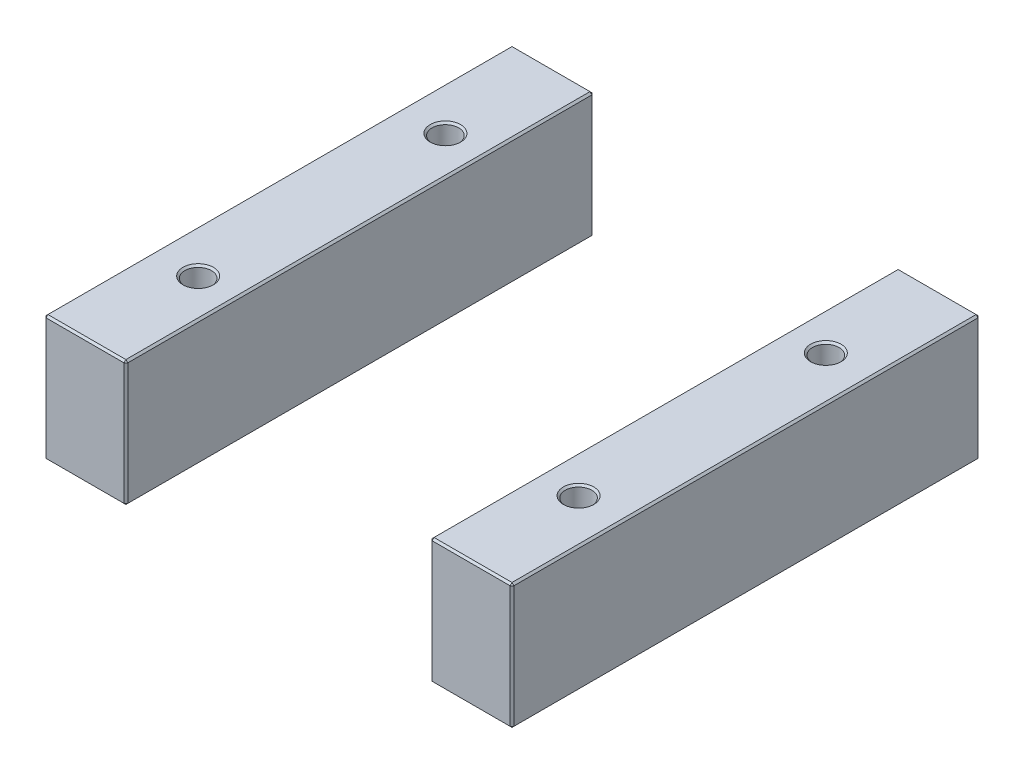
ISO-10303-21;
HEADER;
FILE_DESCRIPTION(('STEP AP214'),'2;1');
FILE_NAME('part.step','',(''),(''),'','','');
FILE_SCHEMA(('AUTOMOTIVE_DESIGN { 1 0 10303 214 1 1 1 1 }'));
ENDSEC;
DATA;
#1=APPLICATION_CONTEXT('core data for automotive mechanical design processes');
#2=APPLICATION_PROTOCOL_DEFINITION('international standard','automotive_design',2000,#1);
#3=PRODUCT_CONTEXT('',#1,'mechanical');
#4=PRODUCT('Part','Part','',(#3));
#5=PRODUCT_RELATED_PRODUCT_CATEGORY('part','',(#4));
#6=PRODUCT_DEFINITION_FORMATION('','',#4);
#7=PRODUCT_DEFINITION_CONTEXT('part definition',#1,'design');
#8=PRODUCT_DEFINITION('design','',#6,#7);
#9=PRODUCT_DEFINITION_SHAPE('','',#8);
#10=(LENGTH_UNIT() NAMED_UNIT(*) SI_UNIT(.MILLI.,.METRE.));
#11=(NAMED_UNIT(*) PLANE_ANGLE_UNIT() SI_UNIT($,.RADIAN.));
#12=(NAMED_UNIT(*) SI_UNIT($,.STERADIAN.) SOLID_ANGLE_UNIT());
#13=UNCERTAINTY_MEASURE_WITH_UNIT(LENGTH_MEASURE(1.E-05),#10,'distance_accuracy_value','');
#14=(GEOMETRIC_REPRESENTATION_CONTEXT(3) GLOBAL_UNCERTAINTY_ASSIGNED_CONTEXT((#13)) GLOBAL_UNIT_ASSIGNED_CONTEXT((#10,
#11,#12)) REPRESENTATION_CONTEXT('',''));
#15=CARTESIAN_POINT('',(0.,0.,0.));
#16=DIRECTION('',(0.,0.,1.));
#17=DIRECTION('',(1.,0.,0.));
#18=AXIS2_PLACEMENT_3D('',#15,#16,#17);
#19=CARTESIAN_POINT('',(-123.,66.,-123.));
#20=DIRECTION('',(0.,0.,1.));
#21=DIRECTION('',(1.,0.,0.));
#22=AXIS2_PLACEMENT_3D('',#19,#20,#21);
#23=PLANE('',#22);
#24=DIRECTION('',(-1.,0.,0.));
#25=VECTOR('',#24,1.);
#26=CARTESIAN_POINT('',(-123.,0.999999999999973,-123.));
#27=LINE('',#26,#25);
#28=CARTESIAN_POINT('',(-81.,0.999999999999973,-123.));
#29=VERTEX_POINT('',#28);
#30=CARTESIAN_POINT('',(-122.,0.999999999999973,-123.));
#31=VERTEX_POINT('',#30);
#32=EDGE_CURVE('P0_E137',#29,#31,#27,.T.);
#33=ORIENTED_EDGE('',*,*,#32,.T.);
#34=DIRECTION('',(0.,1.,0.));
#35=VECTOR('',#34,1.);
#36=CARTESIAN_POINT('',(-122.,66.,-123.));
#37=LINE('',#36,#35);
#38=CARTESIAN_POINT('',(-122.,65.,-123.));
#39=VERTEX_POINT('',#38);
#40=EDGE_CURVE('P0_E235',#31,#39,#37,.T.);
#41=ORIENTED_EDGE('',*,*,#40,.T.);
#42=DIRECTION('',(1.,0.,0.));
#43=VECTOR('',#42,1.);
#44=CARTESIAN_POINT('',(-123.,65.,-123.));
#45=LINE('',#44,#43);
#46=CARTESIAN_POINT('',(-81.,65.,-123.));
#47=VERTEX_POINT('',#46);
#48=EDGE_CURVE('P0_E233',#39,#47,#45,.T.);
#49=ORIENTED_EDGE('',*,*,#48,.T.);
#50=DIRECTION('',(0.,-1.,0.));
#51=VECTOR('',#50,1.);
#52=CARTESIAN_POINT('',(-81.,66.,-123.));
#53=LINE('',#52,#51);
#54=EDGE_CURVE('P0_E230',#47,#29,#53,.T.);
#55=ORIENTED_EDGE('',*,*,#54,.T.);
#56=EDGE_LOOP('',(#33,#41,#49,#55));
#57=FACE_BOUND('',#56,.T.);
#58=ADVANCED_FACE('P0_F16',(#57),#23,.F.);
#59=CARTESIAN_POINT('',(-123.,66.,123.));
#60=DIRECTION('',(1.,0.,0.));
#61=DIRECTION('',(0.,0.,-1.));
#62=AXIS2_PLACEMENT_3D('',#59,#60,#61);
#63=PLANE('',#62);
#64=DIRECTION('',(0.,1.,0.));
#65=VECTOR('',#64,1.);
#66=CARTESIAN_POINT('',(-123.,66.,122.));
#67=LINE('',#66,#65);
#68=CARTESIAN_POINT('',(-123.,0.999999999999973,122.));
#69=VERTEX_POINT('',#68);
#70=CARTESIAN_POINT('',(-123.,65.,122.));
#71=VERTEX_POINT('',#70);
#72=EDGE_CURVE('P0_E217',#69,#71,#67,.T.);
#73=ORIENTED_EDGE('',*,*,#72,.T.);
#74=DIRECTION('',(0.,0.,-1.));
#75=VECTOR('',#74,1.);
#76=CARTESIAN_POINT('',(-123.,65.,123.));
#77=LINE('',#76,#75);
#78=CARTESIAN_POINT('',(-123.,65.,-122.));
#79=VERTEX_POINT('',#78);
#80=EDGE_CURVE('P0_E228',#71,#79,#77,.T.);
#81=ORIENTED_EDGE('',*,*,#80,.T.);
#82=DIRECTION('',(0.,-1.,0.));
#83=VECTOR('',#82,1.);
#84=CARTESIAN_POINT('',(-123.,66.,-122.));
#85=LINE('',#84,#83);
#86=CARTESIAN_POINT('',(-123.,0.999999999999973,-122.));
#87=VERTEX_POINT('',#86);
#88=EDGE_CURVE('P0_E225',#79,#87,#85,.T.);
#89=ORIENTED_EDGE('',*,*,#88,.T.);
#90=DIRECTION('',(0.,0.,1.));
#91=VECTOR('',#90,1.);
#92=CARTESIAN_POINT('',(-123.,0.999999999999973,123.));
#93=LINE('',#92,#91);
#94=EDGE_CURVE('P0_E214',#87,#69,#93,.T.);
#95=ORIENTED_EDGE('',*,*,#94,.T.);
#96=EDGE_LOOP('',(#73,#81,#89,#95));
#97=FACE_BOUND('',#96,.T.);
#98=ADVANCED_FACE('P0_F302',(#97),#63,.F.);
#99=CARTESIAN_POINT('',(-123.,66.,123.));
#100=DIRECTION('',(0.,0.,-1.));
#101=DIRECTION('',(-1.,0.,0.));
#102=AXIS2_PLACEMENT_3D('',#99,#100,#101);
#103=PLANE('',#102);
#104=DIRECTION('',(-1.,0.,0.));
#105=VECTOR('',#104,1.);
#106=CARTESIAN_POINT('',(-123.,65.,123.));
#107=LINE('',#106,#105);
#108=CARTESIAN_POINT('',(-81.,65.,123.));
#109=VERTEX_POINT('',#108);
#110=CARTESIAN_POINT('',(-122.,65.,123.));
#111=VERTEX_POINT('',#110);
#112=EDGE_CURVE('P0_E242',#109,#111,#107,.T.);
#113=ORIENTED_EDGE('',*,*,#112,.T.);
#114=DIRECTION('',(0.,-1.,0.));
#115=VECTOR('',#114,1.);
#116=CARTESIAN_POINT('',(-122.,66.,123.));
#117=LINE('',#116,#115);
#118=CARTESIAN_POINT('',(-122.,0.999999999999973,123.));
#119=VERTEX_POINT('',#118);
#120=EDGE_CURVE('P0_E244',#111,#119,#117,.T.);
#121=ORIENTED_EDGE('',*,*,#120,.T.);
#122=DIRECTION('',(1.,0.,0.));
#123=VECTOR('',#122,1.);
#124=CARTESIAN_POINT('',(-80.,0.999999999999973,123.));
#125=LINE('',#124,#123);
#126=CARTESIAN_POINT('',(-81.,0.999999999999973,123.));
#127=VERTEX_POINT('',#126);
#128=EDGE_CURVE('P0_E240',#119,#127,#125,.T.);
#129=ORIENTED_EDGE('',*,*,#128,.T.);
#130=DIRECTION('',(0.,1.,0.));
#131=VECTOR('',#130,1.);
#132=CARTESIAN_POINT('',(-81.,66.,123.));
#133=LINE('',#132,#131);
#134=EDGE_CURVE('P0_E238',#127,#109,#133,.T.);
#135=ORIENTED_EDGE('',*,*,#134,.T.);
#136=EDGE_LOOP('',(#113,#121,#129,#135));
#137=FACE_BOUND('',#136,.T.);
#138=ADVANCED_FACE('P0_F341',(#137),#103,.F.);
#139=CARTESIAN_POINT('',(-80.,66.,-123.));
#140=DIRECTION('',(-1.,0.,0.));
#141=DIRECTION('',(0.,0.,1.));
#142=AXIS2_PLACEMENT_3D('',#139,#140,#141);
#143=PLANE('',#142);
#144=DIRECTION('',(0.,0.,1.));
#145=VECTOR('',#144,1.);
#146=CARTESIAN_POINT('',(-80.,65.,-123.));
#147=LINE('',#146,#145);
#148=CARTESIAN_POINT('',(-80.,65.,-122.));
#149=VERTEX_POINT('',#148);
#150=CARTESIAN_POINT('',(-80.,65.,122.));
#151=VERTEX_POINT('',#150);
#152=EDGE_CURVE('P0_E31',#149,#151,#147,.T.);
#153=ORIENTED_EDGE('',*,*,#152,.T.);
#154=DIRECTION('',(0.,-1.,0.));
#155=VECTOR('',#154,1.);
#156=CARTESIAN_POINT('',(-80.,66.,122.));
#157=LINE('',#156,#155);
#158=CARTESIAN_POINT('',(-80.,0.999999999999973,122.));
#159=VERTEX_POINT('',#158);
#160=EDGE_CURVE('P0_E190',#151,#159,#157,.T.);
#161=ORIENTED_EDGE('',*,*,#160,.T.);
#162=DIRECTION('',(0.,0.,-1.));
#163=VECTOR('',#162,1.);
#164=CARTESIAN_POINT('',(-80.,0.999999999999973,-123.));
#165=LINE('',#164,#163);
#166=CARTESIAN_POINT('',(-80.,0.999999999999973,-122.));
#167=VERTEX_POINT('',#166);
#168=EDGE_CURVE('P0_E256',#159,#167,#165,.T.);
#169=ORIENTED_EDGE('',*,*,#168,.T.);
#170=DIRECTION('',(0.,1.,0.));
#171=VECTOR('',#170,1.);
#172=CARTESIAN_POINT('',(-80.,66.,-122.));
#173=LINE('',#172,#171);
#174=EDGE_CURVE('P0_E36',#167,#149,#173,.T.);
#175=ORIENTED_EDGE('',*,*,#174,.T.);
#176=EDGE_LOOP('',(#153,#161,#169,#175));
#177=FACE_BOUND('',#176,.T.);
#178=ADVANCED_FACE('P0_F535',(#177),#143,.F.);
#179=CARTESIAN_POINT('',(0.,66.,0.));
#180=DIRECTION('',(0.,-1.,0.));
#181=DIRECTION('',(0.,0.,-1.));
#182=AXIS2_PLACEMENT_3D('',#179,#180,#181);
#183=PLANE('',#182);
#184=CARTESIAN_POINT('',(-100.,66.,65.));
#185=DIRECTION('',(0.,-1.,0.));
#186=DIRECTION('',(0.,0.,-1.));
#187=AXIS2_PLACEMENT_3D('',#184,#185,#186);
#188=CIRCLE('',#187,8.);
#189=CARTESIAN_POINT('',(-100.,66.,57.));
#190=VERTEX_POINT('',#189);
#191=EDGE_CURVE('P0_E24',#190,#190,#188,.T.);
#192=ORIENTED_EDGE('',*,*,#191,.T.);
#193=EDGE_LOOP('',(#192));
#194=FACE_BOUND('',#193,.T.);
#195=CARTESIAN_POINT('',(-100.,66.,-65.));
#196=DIRECTION('',(0.,-1.,0.));
#197=DIRECTION('',(0.,0.,-1.));
#198=AXIS2_PLACEMENT_3D('',#195,#196,#197);
#199=CIRCLE('',#198,8.);
#200=CARTESIAN_POINT('',(-100.,66.,-73.));
#201=VERTEX_POINT('',#200);
#202=EDGE_CURVE('P0_E189',#201,#201,#199,.T.);
#203=ORIENTED_EDGE('',*,*,#202,.T.);
#204=EDGE_LOOP('',(#203));
#205=FACE_BOUND('',#204,.T.);
#206=DIRECTION('',(0.,0.,1.));
#207=VECTOR('',#206,1.);
#208=CARTESIAN_POINT('',(-122.,66.,0.));
#209=LINE('',#208,#207);
#210=CARTESIAN_POINT('',(-122.,66.,-122.));
#211=VERTEX_POINT('',#210);
#212=CARTESIAN_POINT('',(-122.,66.,122.));
#213=VERTEX_POINT('',#212);
#214=EDGE_CURVE('P0_E251',#211,#213,#209,.T.);
#215=ORIENTED_EDGE('',*,*,#214,.T.);
#216=DIRECTION('',(1.,0.,0.));
#217=VECTOR('',#216,1.);
#218=CARTESIAN_POINT('',(0.,66.,122.));
#219=LINE('',#218,#217);
#220=CARTESIAN_POINT('',(-81.,66.,122.));
#221=VERTEX_POINT('',#220);
#222=EDGE_CURVE('P0_E253',#213,#221,#219,.T.);
#223=ORIENTED_EDGE('',*,*,#222,.T.);
#224=DIRECTION('',(0.,0.,-1.));
#225=VECTOR('',#224,1.);
#226=CARTESIAN_POINT('',(-81.,66.,0.));
#227=LINE('',#226,#225);
#228=CARTESIAN_POINT('',(-81.,66.,-122.));
#229=VERTEX_POINT('',#228);
#230=EDGE_CURVE('P0_E247',#221,#229,#227,.T.);
#231=ORIENTED_EDGE('',*,*,#230,.T.);
#232=DIRECTION('',(-1.,0.,0.));
#233=VECTOR('',#232,1.);
#234=CARTESIAN_POINT('',(0.,66.,-122.));
#235=LINE('',#234,#233);
#236=EDGE_CURVE('P0_E249',#229,#211,#235,.T.);
#237=ORIENTED_EDGE('',*,*,#236,.T.);
#238=EDGE_LOOP('',(#215,#223,#231,#237));
#239=FACE_BOUND('',#238,.T.);
#240=ADVANCED_FACE('P0_F195',(#194,#205,#239),#183,.F.);
#241=CARTESIAN_POINT('',(0.,0.,0.));
#242=DIRECTION('',(0.,-1.,0.));
#243=DIRECTION('',(0.,0.,-1.));
#244=AXIS2_PLACEMENT_3D('',#241,#242,#243);
#245=PLANE('',#244);
#246=CARTESIAN_POINT('',(-100.,0.,-65.));
#247=DIRECTION('',(0.,-1.,0.));
#248=DIRECTION('',(0.,0.,-1.));
#249=AXIS2_PLACEMENT_3D('',#246,#247,#248);
#250=CIRCLE('',#249,8.);
#251=CARTESIAN_POINT('',(-100.,0.,-73.));
#252=VERTEX_POINT('',#251);
#253=EDGE_CURVE('P0_E220',#252,#252,#250,.F.);
#254=ORIENTED_EDGE('',*,*,#253,.T.);
#255=EDGE_LOOP('',(#254));
#256=FACE_BOUND('',#255,.T.);
#257=CARTESIAN_POINT('',(-100.,0.,65.));
#258=DIRECTION('',(0.,-1.,0.));
#259=DIRECTION('',(0.,0.,-1.));
#260=AXIS2_PLACEMENT_3D('',#257,#258,#259);
#261=CIRCLE('',#260,8.);
#262=CARTESIAN_POINT('',(-100.,0.,57.));
#263=VERTEX_POINT('',#262);
#264=EDGE_CURVE('P0_E608',#263,#263,#261,.F.);
#265=ORIENTED_EDGE('',*,*,#264,.T.);
#266=EDGE_LOOP('',(#265));
#267=FACE_BOUND('',#266,.T.);
#268=DIRECTION('',(-1.,0.,0.));
#269=VECTOR('',#268,1.);
#270=CARTESIAN_POINT('',(-123.,0.,122.));
#271=LINE('',#270,#269);
#272=CARTESIAN_POINT('',(-81.,0.,122.));
#273=VERTEX_POINT('',#272);
#274=CARTESIAN_POINT('',(-122.,0.,122.));
#275=VERTEX_POINT('',#274);
#276=EDGE_CURVE('P0_E114',#273,#275,#271,.T.);
#277=ORIENTED_EDGE('',*,*,#276,.T.);
#278=DIRECTION('',(0.,0.,-1.));
#279=VECTOR('',#278,1.);
#280=CARTESIAN_POINT('',(-122.,0.,-123.));
#281=LINE('',#280,#279);
#282=CARTESIAN_POINT('',(-122.,0.,-122.));
#283=VERTEX_POINT('',#282);
#284=EDGE_CURVE('P0_E110',#275,#283,#281,.T.);
#285=ORIENTED_EDGE('',*,*,#284,.T.);
#286=DIRECTION('',(1.,0.,0.));
#287=VECTOR('',#286,1.);
#288=CARTESIAN_POINT('',(-80.,0.,-122.));
#289=LINE('',#288,#287);
#290=CARTESIAN_POINT('',(-81.,0.,-122.));
#291=VERTEX_POINT('',#290);
#292=EDGE_CURVE('P0_E104',#283,#291,#289,.T.);
#293=ORIENTED_EDGE('',*,*,#292,.T.);
#294=DIRECTION('',(0.,0.,1.));
#295=VECTOR('',#294,1.);
#296=CARTESIAN_POINT('',(-81.,0.,123.));
#297=LINE('',#296,#295);
#298=EDGE_CURVE('P0_E107',#291,#273,#297,.T.);
#299=ORIENTED_EDGE('',*,*,#298,.T.);
#300=EDGE_LOOP('',(#277,#285,#293,#299));
#301=FACE_BOUND('',#300,.T.);
#302=ADVANCED_FACE('P0_F106',(#256,#267,#301),#245,.T.);
#303=CARTESIAN_POINT('',(-100.,0.,-65.));
#304=DIRECTION('',(0.,1.,0.));
#305=DIRECTION('',(0.,0.,1.));
#306=AXIS2_PLACEMENT_3D('',#303,#304,#305);
#307=CYLINDRICAL_SURFACE('',#306,7.);
#308=CARTESIAN_POINT('',(-100.,65.,-65.));
#309=DIRECTION('',(0.,-1.,0.));
#310=DIRECTION('',(0.,0.,-1.));
#311=AXIS2_PLACEMENT_3D('',#308,#309,#310);
#312=CIRCLE('',#311,7.);
#313=CARTESIAN_POINT('',(-100.,65.,-72.));
#314=VERTEX_POINT('',#313);
#315=EDGE_CURVE('P0_E10',#314,#314,#312,.F.);
#316=ORIENTED_EDGE('',*,*,#315,.T.);
#317=EDGE_LOOP('',(#316));
#318=FACE_BOUND('',#317,.T.);
#319=CARTESIAN_POINT('',(-100.,0.999999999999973,-65.));
#320=DIRECTION('',(0.,-1.,0.));
#321=DIRECTION('',(0.,0.,-1.));
#322=AXIS2_PLACEMENT_3D('',#319,#320,#321);
#323=CIRCLE('',#322,7.);
#324=CARTESIAN_POINT('',(-100.,0.999999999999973,-72.));
#325=VERTEX_POINT('',#324);
#326=EDGE_CURVE('P0_E215',#325,#325,#323,.T.);
#327=ORIENTED_EDGE('',*,*,#326,.T.);
#328=EDGE_LOOP('',(#327));
#329=FACE_BOUND('',#328,.T.);
#330=ADVANCED_FACE('P0_F208',(#318,#329),#307,.F.);
#331=CARTESIAN_POINT('',(-100.,0.,65.));
#332=DIRECTION('',(0.,1.,0.));
#333=DIRECTION('',(0.,0.,1.));
#334=AXIS2_PLACEMENT_3D('',#331,#332,#333);
#335=CYLINDRICAL_SURFACE('',#334,7.);
#336=CARTESIAN_POINT('',(-100.,65.,65.));
#337=DIRECTION('',(0.,-1.,0.));
#338=DIRECTION('',(0.,0.,-1.));
#339=AXIS2_PLACEMENT_3D('',#336,#337,#338);
#340=CIRCLE('',#339,7.);
#341=CARTESIAN_POINT('',(-100.,65.,58.));
#342=VERTEX_POINT('',#341);
#343=EDGE_CURVE('P0_E186',#342,#342,#340,.F.);
#344=ORIENTED_EDGE('',*,*,#343,.T.);
#345=EDGE_LOOP('',(#344));
#346=FACE_BOUND('',#345,.T.);
#347=CARTESIAN_POINT('',(-100.,1.00000000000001,65.));
#348=DIRECTION('',(0.,-1.,0.));
#349=DIRECTION('',(0.,0.,-1.));
#350=AXIS2_PLACEMENT_3D('',#347,#348,#349);
#351=CIRCLE('',#350,7.);
#352=CARTESIAN_POINT('',(-100.,1.00000000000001,58.));
#353=VERTEX_POINT('',#352);
#354=EDGE_CURVE('P0_E212',#353,#353,#351,.T.);
#355=ORIENTED_EDGE('',*,*,#354,.T.);
#356=EDGE_LOOP('',(#355));
#357=FACE_BOUND('',#356,.T.);
#358=ADVANCED_FACE('P0_F204',(#346,#357),#335,.F.);
#359=CARTESIAN_POINT('',(-100.,0.,-65.));
#360=DIRECTION('',(0.,-1.,0.));
#361=DIRECTION('',(0.,0.,-1.));
#362=AXIS2_PLACEMENT_3D('',#359,#360,#361);
#363=CONICAL_SURFACE('',#362,8.,0.78539816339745);
#364=ORIENTED_EDGE('',*,*,#326,.F.);
#365=EDGE_LOOP('',(#364));
#366=FACE_BOUND('',#365,.T.);
#367=ORIENTED_EDGE('',*,*,#253,.F.);
#368=EDGE_LOOP('',(#367));
#369=FACE_BOUND('',#368,.T.);
#370=ADVANCED_FACE('P0_F207',(#366,#369),#363,.F.);
#371=CARTESIAN_POINT('',(-100.,0.,65.));
#372=DIRECTION('',(0.,-1.,0.));
#373=DIRECTION('',(0.,0.,-1.));
#374=AXIS2_PLACEMENT_3D('',#371,#372,#373);
#375=CONICAL_SURFACE('',#374,8.,0.785398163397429);
#376=ORIENTED_EDGE('',*,*,#354,.F.);
#377=EDGE_LOOP('',(#376));
#378=FACE_BOUND('',#377,.T.);
#379=ORIENTED_EDGE('',*,*,#264,.F.);
#380=EDGE_LOOP('',(#379));
#381=FACE_BOUND('',#380,.T.);
#382=ADVANCED_FACE('P0_F347',(#378,#381),#375,.F.);
#383=CARTESIAN_POINT('',(-80.,66.,122.));
#384=DIRECTION('',(-0.707106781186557,0.,-0.707106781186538));
#385=DIRECTION('',(0.,-1.,0.));
#386=AXIS2_PLACEMENT_3D('',#383,#384,#385);
#387=PLANE('',#386);
#388=DIRECTION('',(-0.707106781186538,0.,0.707106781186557));
#389=VECTOR('',#388,1.);
#390=CARTESIAN_POINT('',(-80.5,65.,122.5));
#391=LINE('',#390,#389);
#392=EDGE_CURVE('P0_E125',#109,#151,#391,.F.);
#393=ORIENTED_EDGE('',*,*,#392,.F.);
#394=ORIENTED_EDGE('',*,*,#134,.F.);
#395=DIRECTION('',(0.707106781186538,0.,-0.707106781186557));
#396=VECTOR('',#395,1.);
#397=CARTESIAN_POINT('',(-81.,0.999999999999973,123.));
#398=LINE('',#397,#396);
#399=EDGE_CURVE('P0_E181',#159,#127,#398,.F.);
#400=ORIENTED_EDGE('',*,*,#399,.F.);
#401=ORIENTED_EDGE('',*,*,#160,.F.);
#402=EDGE_LOOP('',(#393,#394,#400,#401));
#403=FACE_BOUND('',#402,.T.);
#404=ADVANCED_FACE('P0_F351',(#403),#387,.F.);
#405=CARTESIAN_POINT('',(-81.,66.,122.));
#406=DIRECTION('',(0.577350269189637,0.57735026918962,0.57735026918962));
#407=DIRECTION('',(0.707106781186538,0.,-0.707106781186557));
#408=AXIS2_PLACEMENT_3D('',#405,#406,#407);
#409=PLANE('',#408);
#410=DIRECTION('',(0.,0.707106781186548,-0.707106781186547));
#411=VECTOR('',#410,1.);
#412=CARTESIAN_POINT('',(-81.,66.,122.));
#413=LINE('',#412,#411);
#414=EDGE_CURVE('P0_E175',#109,#221,#413,.T.);
#415=ORIENTED_EDGE('',*,*,#414,.F.);
#416=ORIENTED_EDGE('',*,*,#392,.T.);
#417=DIRECTION('',(0.70710678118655,-0.707106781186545,0.));
#418=VECTOR('',#417,1.);
#419=CARTESIAN_POINT('',(-81.,66.,122.));
#420=LINE('',#419,#418);
#421=EDGE_CURVE('P0_E178',#221,#151,#420,.T.);
#422=ORIENTED_EDGE('',*,*,#421,.F.);
#423=EDGE_LOOP('',(#415,#416,#422));
#424=FACE_BOUND('',#423,.T.);
#425=ADVANCED_FACE('P0_F487',(#424),#409,.T.);
#426=CARTESIAN_POINT('',(-81.,0.999999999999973,123.));
#427=DIRECTION('',(0.577350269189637,-0.57735026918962,0.57735026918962));
#428=DIRECTION('',(0.707106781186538,0.,-0.707106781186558));
#429=AXIS2_PLACEMENT_3D('',#426,#427,#428);
#430=PLANE('',#429);
#431=DIRECTION('',(0.70710678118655,0.707106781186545,0.));
#432=VECTOR('',#431,1.);
#433=CARTESIAN_POINT('',(-80.5,0.499999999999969,122.));
#434=LINE('',#433,#432);
#435=EDGE_CURVE('P0_E123',#159,#273,#434,.F.);
#436=ORIENTED_EDGE('',*,*,#435,.F.);
#437=ORIENTED_EDGE('',*,*,#399,.T.);
#438=DIRECTION('',(0.,-0.707106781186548,-0.707106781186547));
#439=VECTOR('',#438,1.);
#440=CARTESIAN_POINT('',(-81.,0.999999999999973,123.));
#441=LINE('',#440,#439);
#442=EDGE_CURVE('P0_E172',#273,#127,#441,.F.);
#443=ORIENTED_EDGE('',*,*,#442,.F.);
#444=EDGE_LOOP('',(#436,#437,#443));
#445=FACE_BOUND('',#444,.T.);
#446=ADVANCED_FACE('P0_F478',(#445),#430,.T.);
#447=CARTESIAN_POINT('',(-81.,66.,0.));
#448=DIRECTION('',(-0.707106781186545,-0.70710678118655,0.));
#449=DIRECTION('',(0.,0.,-1.));
#450=AXIS2_PLACEMENT_3D('',#447,#448,#449);
#451=PLANE('',#450);
#452=ORIENTED_EDGE('',*,*,#421,.T.);
#453=ORIENTED_EDGE('',*,*,#152,.F.);
#454=DIRECTION('',(-0.70710678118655,0.707106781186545,0.));
#455=VECTOR('',#454,1.);
#456=CARTESIAN_POINT('',(-80.5,65.5,-122.));
#457=LINE('',#456,#455);
#458=EDGE_CURVE('P0_E165',#229,#149,#457,.F.);
#459=ORIENTED_EDGE('',*,*,#458,.F.);
#460=ORIENTED_EDGE('',*,*,#230,.F.);
#461=EDGE_LOOP('',(#452,#453,#459,#460));
#462=FACE_BOUND('',#461,.T.);
#463=ADVANCED_FACE('P0_F318',(#462),#451,.F.);
#464=CARTESIAN_POINT('',(0.,66.,122.));
#465=DIRECTION('',(0.,-0.707106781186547,-0.707106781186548));
#466=DIRECTION('',(1.,0.,0.));
#467=AXIS2_PLACEMENT_3D('',#464,#465,#466);
#468=PLANE('',#467);
#469=ORIENTED_EDGE('',*,*,#414,.T.);
#470=ORIENTED_EDGE('',*,*,#222,.F.);
#471=DIRECTION('',(0.,-0.707106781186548,0.707106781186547));
#472=VECTOR('',#471,1.);
#473=CARTESIAN_POINT('',(-122.,65.5,122.5));
#474=LINE('',#473,#472);
#475=EDGE_CURVE('P0_E162',#111,#213,#474,.F.);
#476=ORIENTED_EDGE('',*,*,#475,.F.);
#477=ORIENTED_EDGE('',*,*,#112,.F.);
#478=EDGE_LOOP('',(#469,#470,#476,#477));
#479=FACE_BOUND('',#478,.T.);
#480=ADVANCED_FACE('P0_F313',(#479),#468,.F.);
#481=CARTESIAN_POINT('',(-122.,66.,123.));
#482=DIRECTION('',(0.707106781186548,0.,-0.707106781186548));
#483=DIRECTION('',(0.,-1.,0.));
#484=AXIS2_PLACEMENT_3D('',#481,#482,#483);
#485=PLANE('',#484);
#486=DIRECTION('',(0.707106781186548,0.,0.707106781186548));
#487=VECTOR('',#486,1.);
#488=CARTESIAN_POINT('',(-122.,0.999999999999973,123.));
#489=LINE('',#488,#487);
#490=EDGE_CURVE('P0_E156',#119,#69,#489,.F.);
#491=ORIENTED_EDGE('',*,*,#490,.F.);
#492=ORIENTED_EDGE('',*,*,#120,.F.);
#493=DIRECTION('',(-0.707106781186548,0.,-0.707106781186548));
#494=VECTOR('',#493,1.);
#495=CARTESIAN_POINT('',(-123.,65.,122.));
#496=LINE('',#495,#494);
#497=EDGE_CURVE('P0_E159',#71,#111,#496,.F.);
#498=ORIENTED_EDGE('',*,*,#497,.F.);
#499=ORIENTED_EDGE('',*,*,#72,.F.);
#500=EDGE_LOOP('',(#491,#492,#498,#499));
#501=FACE_BOUND('',#500,.T.);
#502=ADVANCED_FACE('P0_F307',(#501),#485,.F.);
#503=CARTESIAN_POINT('',(-123.,0.999999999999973,123.));
#504=DIRECTION('',(0.,-0.707106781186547,0.707106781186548));
#505=DIRECTION('',(-1.,0.,0.));
#506=AXIS2_PLACEMENT_3D('',#503,#504,#505);
#507=PLANE('',#506);
#508=ORIENTED_EDGE('',*,*,#442,.T.);
#509=ORIENTED_EDGE('',*,*,#128,.F.);
#510=DIRECTION('',(0.,0.707106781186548,0.707106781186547));
#511=VECTOR('',#510,1.);
#512=CARTESIAN_POINT('',(-122.,0.999999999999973,123.));
#513=LINE('',#512,#511);
#514=EDGE_CURVE('P0_E134',#275,#119,#513,.T.);
#515=ORIENTED_EDGE('',*,*,#514,.F.);
#516=ORIENTED_EDGE('',*,*,#276,.F.);
#517=EDGE_LOOP('',(#508,#509,#515,#516));
#518=FACE_BOUND('',#517,.T.);
#519=ADVANCED_FACE('P0_F333',(#518),#507,.T.);
#520=CARTESIAN_POINT('',(-80.,0.999999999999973,-123.));
#521=DIRECTION('',(0.707106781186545,-0.70710678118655,0.));
#522=DIRECTION('',(0.,0.,1.));
#523=AXIS2_PLACEMENT_3D('',#520,#521,#522);
#524=PLANE('',#523);
#525=ORIENTED_EDGE('',*,*,#435,.T.);
#526=ORIENTED_EDGE('',*,*,#298,.F.);
#527=DIRECTION('',(-0.70710678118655,-0.707106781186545,0.));
#528=VECTOR('',#527,1.);
#529=CARTESIAN_POINT('',(-81.,0.,-122.));
#530=LINE('',#529,#528);
#531=EDGE_CURVE('P0_E120',#167,#291,#530,.T.);
#532=ORIENTED_EDGE('',*,*,#531,.F.);
#533=ORIENTED_EDGE('',*,*,#168,.F.);
#534=EDGE_LOOP('',(#525,#526,#532,#533));
#535=FACE_BOUND('',#534,.T.);
#536=ADVANCED_FACE('P0_F119',(#535),#524,.T.);
#537=CARTESIAN_POINT('',(-81.,66.,-123.));
#538=DIRECTION('',(-0.707106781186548,0.,0.707106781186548));
#539=DIRECTION('',(0.,-1.,0.));
#540=AXIS2_PLACEMENT_3D('',#537,#538,#539);
#541=PLANE('',#540);
#542=DIRECTION('',(0.707106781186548,0.,0.707106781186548));
#543=VECTOR('',#542,1.);
#544=CARTESIAN_POINT('',(-81.,65.,-123.));
#545=LINE('',#544,#543);
#546=EDGE_CURVE('P0_E168',#149,#47,#545,.F.);
#547=ORIENTED_EDGE('',*,*,#546,.F.);
#548=ORIENTED_EDGE('',*,*,#174,.F.);
#549=DIRECTION('',(-0.707106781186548,0.,-0.707106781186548));
#550=VECTOR('',#549,1.);
#551=CARTESIAN_POINT('',(-80.5,0.999999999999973,-122.5));
#552=LINE('',#551,#550);
#553=EDGE_CURVE('P0_E133',#29,#167,#552,.F.);
#554=ORIENTED_EDGE('',*,*,#553,.F.);
#555=ORIENTED_EDGE('',*,*,#54,.F.);
#556=EDGE_LOOP('',(#547,#548,#554,#555));
#557=FACE_BOUND('',#556,.T.);
#558=ADVANCED_FACE('P0_F323',(#557),#541,.F.);
#559=CARTESIAN_POINT('',(-81.,65.,-123.));
#560=DIRECTION('',(0.577350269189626,0.577350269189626,-0.577350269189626));
#561=DIRECTION('',(-0.707106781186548,0.,-0.707106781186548));
#562=AXIS2_PLACEMENT_3D('',#559,#560,#561);
#563=PLANE('',#562);
#564=ORIENTED_EDGE('',*,*,#458,.T.);
#565=ORIENTED_EDGE('',*,*,#546,.T.);
#566=DIRECTION('',(0.,-0.707106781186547,-0.707106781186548));
#567=VECTOR('',#566,1.);
#568=CARTESIAN_POINT('',(-81.,65.,-123.));
#569=LINE('',#568,#567);
#570=EDGE_CURVE('P0_E151',#229,#47,#569,.T.);
#571=ORIENTED_EDGE('',*,*,#570,.F.);
#572=EDGE_LOOP('',(#564,#565,#571));
#573=FACE_BOUND('',#572,.T.);
#574=ADVANCED_FACE('P0_F321',(#573),#563,.T.);
#575=CARTESIAN_POINT('',(-123.,65.,122.));
#576=DIRECTION('',(-0.577350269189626,0.577350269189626,0.577350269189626));
#577=DIRECTION('',(0.707106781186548,0.,0.707106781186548));
#578=AXIS2_PLACEMENT_3D('',#575,#576,#577);
#579=PLANE('',#578);
#580=ORIENTED_EDGE('',*,*,#497,.T.);
#581=ORIENTED_EDGE('',*,*,#475,.T.);
#582=DIRECTION('',(0.707106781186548,0.707106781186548,0.));
#583=VECTOR('',#582,1.);
#584=CARTESIAN_POINT('',(-123.,65.,122.));
#585=LINE('',#584,#583);
#586=EDGE_CURVE('P0_E142',#71,#213,#585,.T.);
#587=ORIENTED_EDGE('',*,*,#586,.F.);
#588=EDGE_LOOP('',(#580,#581,#587));
#589=FACE_BOUND('',#588,.T.);
#590=ADVANCED_FACE('P0_F310',(#589),#579,.T.);
#591=CARTESIAN_POINT('',(-122.,0.999999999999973,123.));
#592=DIRECTION('',(-0.577350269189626,-0.577350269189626,0.577350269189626));
#593=DIRECTION('',(0.707106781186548,0.,0.707106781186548));
#594=AXIS2_PLACEMENT_3D('',#591,#592,#593);
#595=PLANE('',#594);
#596=ORIENTED_EDGE('',*,*,#514,.T.);
#597=ORIENTED_EDGE('',*,*,#490,.T.);
#598=DIRECTION('',(0.707106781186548,-0.707106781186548,0.));
#599=VECTOR('',#598,1.);
#600=CARTESIAN_POINT('',(-122.5,0.499999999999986,122.));
#601=LINE('',#600,#599);
#602=EDGE_CURVE('P0_E138',#275,#69,#601,.F.);
#603=ORIENTED_EDGE('',*,*,#602,.F.);
#604=EDGE_LOOP('',(#596,#597,#603));
#605=FACE_BOUND('',#604,.T.);
#606=ADVANCED_FACE('P0_F368',(#605),#595,.T.);
#607=CARTESIAN_POINT('',(-81.,0.,-122.));
#608=DIRECTION('',(0.577350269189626,-0.577350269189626,-0.577350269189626));
#609=DIRECTION('',(-0.707106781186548,0.,-0.707106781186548));
#610=AXIS2_PLACEMENT_3D('',#607,#608,#609);
#611=PLANE('',#610);
#612=ORIENTED_EDGE('',*,*,#553,.T.);
#613=ORIENTED_EDGE('',*,*,#531,.T.);
#614=DIRECTION('',(0.,0.707106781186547,-0.707106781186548));
#615=VECTOR('',#614,1.);
#616=CARTESIAN_POINT('',(-81.,0.,-122.));
#617=LINE('',#616,#615);
#618=EDGE_CURVE('P0_E130',#29,#291,#617,.F.);
#619=ORIENTED_EDGE('',*,*,#618,.F.);
#620=EDGE_LOOP('',(#612,#613,#619));
#621=FACE_BOUND('',#620,.T.);
#622=ADVANCED_FACE('P0_F129',(#621),#611,.T.);
#623=CARTESIAN_POINT('',(0.,66.,-122.));
#624=DIRECTION('',(0.,-0.707106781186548,0.707106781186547));
#625=DIRECTION('',(-1.,0.,0.));
#626=AXIS2_PLACEMENT_3D('',#623,#624,#625);
#627=PLANE('',#626);
#628=ORIENTED_EDGE('',*,*,#570,.T.);
#629=ORIENTED_EDGE('',*,*,#48,.F.);
#630=DIRECTION('',(0.,0.707106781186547,0.707106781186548));
#631=VECTOR('',#630,1.);
#632=CARTESIAN_POINT('',(-122.,65.,-123.));
#633=LINE('',#632,#631);
#634=EDGE_CURVE('P0_E139',#211,#39,#633,.F.);
#635=ORIENTED_EDGE('',*,*,#634,.F.);
#636=ORIENTED_EDGE('',*,*,#236,.F.);
#637=EDGE_LOOP('',(#628,#629,#635,#636));
#638=FACE_BOUND('',#637,.T.);
#639=ADVANCED_FACE('P0_F286',(#638),#627,.F.);
#640=CARTESIAN_POINT('',(-122.,66.,0.));
#641=DIRECTION('',(0.707106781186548,-0.707106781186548,0.));
#642=DIRECTION('',(0.,0.,1.));
#643=AXIS2_PLACEMENT_3D('',#640,#641,#642);
#644=PLANE('',#643);
#645=ORIENTED_EDGE('',*,*,#586,.T.);
#646=ORIENTED_EDGE('',*,*,#214,.F.);
#647=DIRECTION('',(-0.707106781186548,-0.707106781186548,0.));
#648=VECTOR('',#647,1.);
#649=CARTESIAN_POINT('',(-122.5,65.5,-122.));
#650=LINE('',#649,#648);
#651=EDGE_CURVE('P0_E145',#79,#211,#650,.F.);
#652=ORIENTED_EDGE('',*,*,#651,.F.);
#653=ORIENTED_EDGE('',*,*,#80,.F.);
#654=EDGE_LOOP('',(#645,#646,#652,#653));
#655=FACE_BOUND('',#654,.T.);
#656=ADVANCED_FACE('P0_F280',(#655),#644,.F.);
#657=CARTESIAN_POINT('',(-123.,0.999999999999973,123.));
#658=DIRECTION('',(-0.707106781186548,-0.707106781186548,0.));
#659=DIRECTION('',(0.,0.,-1.));
#660=AXIS2_PLACEMENT_3D('',#657,#658,#659);
#661=PLANE('',#660);
#662=ORIENTED_EDGE('',*,*,#602,.T.);
#663=ORIENTED_EDGE('',*,*,#94,.F.);
#664=DIRECTION('',(-0.707106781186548,0.707106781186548,0.));
#665=VECTOR('',#664,1.);
#666=CARTESIAN_POINT('',(-123.,0.999999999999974,-122.));
#667=LINE('',#666,#665);
#668=EDGE_CURVE('P0_E267',#283,#87,#667,.T.);
#669=ORIENTED_EDGE('',*,*,#668,.F.);
#670=ORIENTED_EDGE('',*,*,#284,.F.);
#671=EDGE_LOOP('',(#662,#663,#669,#670));
#672=FACE_BOUND('',#671,.T.);
#673=ADVANCED_FACE('P0_F298',(#672),#661,.T.);
#674=CARTESIAN_POINT('',(-123.,0.999999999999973,-123.));
#675=DIRECTION('',(0.,-0.707106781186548,-0.707106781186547));
#676=DIRECTION('',(1.,0.,0.));
#677=AXIS2_PLACEMENT_3D('',#674,#675,#676);
#678=PLANE('',#677);
#679=ORIENTED_EDGE('',*,*,#618,.T.);
#680=ORIENTED_EDGE('',*,*,#292,.F.);
#681=DIRECTION('',(0.,-0.707106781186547,0.707106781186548));
#682=VECTOR('',#681,1.);
#683=CARTESIAN_POINT('',(-122.,0.499999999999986,-122.5));
#684=LINE('',#683,#682);
#685=EDGE_CURVE('P0_E265',#31,#283,#684,.T.);
#686=ORIENTED_EDGE('',*,*,#685,.F.);
#687=ORIENTED_EDGE('',*,*,#32,.F.);
#688=EDGE_LOOP('',(#679,#680,#686,#687));
#689=FACE_BOUND('',#688,.T.);
#690=ADVANCED_FACE('P0_F136',(#689),#678,.T.);
#691=CARTESIAN_POINT('',(-122.,65.,-123.));
#692=DIRECTION('',(-0.577350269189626,0.577350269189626,-0.577350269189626));
#693=DIRECTION('',(-0.707106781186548,0.,0.707106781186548));
#694=AXIS2_PLACEMENT_3D('',#691,#692,#693);
#695=PLANE('',#694);
#696=ORIENTED_EDGE('',*,*,#651,.T.);
#697=ORIENTED_EDGE('',*,*,#634,.T.);
#698=DIRECTION('',(0.707106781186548,0.,-0.707106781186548));
#699=VECTOR('',#698,1.);
#700=CARTESIAN_POINT('',(-122.,65.,-123.));
#701=LINE('',#700,#699);
#702=EDGE_CURVE('P0_E263',#79,#39,#701,.T.);
#703=ORIENTED_EDGE('',*,*,#702,.F.);
#704=EDGE_LOOP('',(#696,#697,#703));
#705=FACE_BOUND('',#704,.T.);
#706=ADVANCED_FACE('P0_F273',(#705),#695,.T.);
#707=CARTESIAN_POINT('',(-123.,0.999999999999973,-122.));
#708=DIRECTION('',(-0.577350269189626,-0.577350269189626,-0.577350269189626));
#709=DIRECTION('',(-0.707106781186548,0.,0.707106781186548));
#710=AXIS2_PLACEMENT_3D('',#707,#708,#709);
#711=PLANE('',#710);
#712=ORIENTED_EDGE('',*,*,#685,.T.);
#713=ORIENTED_EDGE('',*,*,#668,.T.);
#714=DIRECTION('',(-0.707106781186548,0.,0.707106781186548));
#715=VECTOR('',#714,1.);
#716=CARTESIAN_POINT('',(-123.,0.999999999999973,-122.));
#717=LINE('',#716,#715);
#718=EDGE_CURVE('P0_E261',#31,#87,#717,.T.);
#719=ORIENTED_EDGE('',*,*,#718,.F.);
#720=EDGE_LOOP('',(#712,#713,#719));
#721=FACE_BOUND('',#720,.T.);
#722=ADVANCED_FACE('P0_F294',(#721),#711,.T.);
#723=CARTESIAN_POINT('',(-123.,66.,-122.));
#724=DIRECTION('',(0.707106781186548,0.,0.707106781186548));
#725=DIRECTION('',(0.,-1.,0.));
#726=AXIS2_PLACEMENT_3D('',#723,#724,#725);
#727=PLANE('',#726);
#728=ORIENTED_EDGE('',*,*,#702,.T.);
#729=ORIENTED_EDGE('',*,*,#40,.F.);
#730=ORIENTED_EDGE('',*,*,#718,.T.);
#731=ORIENTED_EDGE('',*,*,#88,.F.);
#732=EDGE_LOOP('',(#728,#729,#730,#731));
#733=FACE_BOUND('',#732,.T.);
#734=ADVANCED_FACE('P0_F201',(#733),#727,.F.);
#735=CARTESIAN_POINT('',(-100.,65.,65.));
#736=DIRECTION('',(0.,1.,0.));
#737=DIRECTION('',(0.,0.,1.));
#738=AXIS2_PLACEMENT_3D('',#735,#736,#737);
#739=CONICAL_SURFACE('',#738,7.,0.785398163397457);
#740=ORIENTED_EDGE('',*,*,#191,.F.);
#741=EDGE_LOOP('',(#740));
#742=FACE_BOUND('',#741,.T.);
#743=ORIENTED_EDGE('',*,*,#343,.F.);
#744=EDGE_LOOP('',(#743));
#745=FACE_BOUND('',#744,.T.);
#746=ADVANCED_FACE('P0_F198',(#742,#745),#739,.F.);
#747=CARTESIAN_POINT('',(-100.,65.,-65.));
#748=DIRECTION('',(0.,1.,0.));
#749=DIRECTION('',(0.,0.,1.));
#750=AXIS2_PLACEMENT_3D('',#747,#748,#749);
#751=CONICAL_SURFACE('',#750,7.,0.785398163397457);
#752=ORIENTED_EDGE('',*,*,#202,.F.);
#753=EDGE_LOOP('',(#752));
#754=FACE_BOUND('',#753,.T.);
#755=ORIENTED_EDGE('',*,*,#315,.F.);
#756=EDGE_LOOP('',(#755));
#757=FACE_BOUND('',#756,.T.);
#758=ADVANCED_FACE('P0_F18',(#754,#757),#751,.F.);
#759=CLOSED_SHELL('',(#58,#98,#138,#178,#240,#302,#330,#358,#370,#382,#404,#425,#446,#463,#480,
#502,#519,#536,#558,#574,#590,#606,#622,#639,#656,#673,#690,#706,#722,#734,#746,#758));
#760=MANIFOLD_SOLID_BREP('P0_B1',#759);
#761=CARTESIAN_POINT('',(123.,66.,123.));
#762=DIRECTION('',(0.,0.,-1.));
#763=DIRECTION('',(-1.,0.,0.));
#764=AXIS2_PLACEMENT_3D('',#761,#762,#763);
#765=PLANE('',#764);
#766=DIRECTION('',(0.,-1.,0.));
#767=VECTOR('',#766,1.);
#768=CARTESIAN_POINT('',(81.,66.,123.));
#769=LINE('',#768,#767);
#770=CARTESIAN_POINT('',(81.,65.,123.));
#771=VERTEX_POINT('',#770);
#772=CARTESIAN_POINT('',(81.,0.999999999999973,123.));
#773=VERTEX_POINT('',#772);
#774=EDGE_CURVE('P1_E174',#771,#773,#769,.T.);
#775=ORIENTED_EDGE('',*,*,#774,.T.);
#776=DIRECTION('',(1.,0.,0.));
#777=VECTOR('',#776,1.);
#778=CARTESIAN_POINT('',(123.,0.999999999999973,123.));
#779=LINE('',#778,#777);
#780=CARTESIAN_POINT('',(122.,0.999999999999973,123.));
#781=VERTEX_POINT('',#780);
#782=EDGE_CURVE('P1_E176',#773,#781,#779,.T.);
#783=ORIENTED_EDGE('',*,*,#782,.T.);
#784=DIRECTION('',(0.,1.,0.));
#785=VECTOR('',#784,1.);
#786=CARTESIAN_POINT('',(122.,66.,123.));
#787=LINE('',#786,#785);
#788=CARTESIAN_POINT('',(122.,65.,123.));
#789=VERTEX_POINT('',#788);
#790=EDGE_CURVE('P1_E172',#781,#789,#787,.T.);
#791=ORIENTED_EDGE('',*,*,#790,.T.);
#792=DIRECTION('',(-1.,0.,0.));
#793=VECTOR('',#792,1.);
#794=CARTESIAN_POINT('',(80.,65.,123.));
#795=LINE('',#794,#793);
#796=EDGE_CURVE('P1_E170',#789,#771,#795,.T.);
#797=ORIENTED_EDGE('',*,*,#796,.T.);
#798=EDGE_LOOP('',(#775,#783,#791,#797));
#799=FACE_BOUND('',#798,.T.);
#800=ADVANCED_FACE('P1_F17',(#799),#765,.F.);
#801=CARTESIAN_POINT('',(123.,66.,123.));
#802=DIRECTION('',(-1.,0.,0.));
#803=DIRECTION('',(0.,0.,1.));
#804=AXIS2_PLACEMENT_3D('',#801,#802,#803);
#805=PLANE('',#804);
#806=DIRECTION('',(0.,0.,1.));
#807=VECTOR('',#806,1.);
#808=CARTESIAN_POINT('',(123.,65.,123.));
#809=LINE('',#808,#807);
#810=CARTESIAN_POINT('',(123.,65.,-122.));
#811=VERTEX_POINT('',#810);
#812=CARTESIAN_POINT('',(123.,65.,122.));
#813=VERTEX_POINT('',#812);
#814=EDGE_CURVE('P1_E188',#811,#813,#809,.T.);
#815=ORIENTED_EDGE('',*,*,#814,.T.);
#816=DIRECTION('',(0.,-1.,0.));
#817=VECTOR('',#816,1.);
#818=CARTESIAN_POINT('',(123.,66.,122.));
#819=LINE('',#818,#817);
#820=CARTESIAN_POINT('',(123.,1.,122.));
#821=VERTEX_POINT('',#820);
#822=EDGE_CURVE('P1_E194',#813,#821,#819,.T.);
#823=ORIENTED_EDGE('',*,*,#822,.T.);
#824=DIRECTION('',(0.,0.,-1.));
#825=VECTOR('',#824,1.);
#826=CARTESIAN_POINT('',(123.,1.,123.));
#827=LINE('',#826,#825);
#828=CARTESIAN_POINT('',(123.,1.,-122.));
#829=VERTEX_POINT('',#828);
#830=EDGE_CURVE('P1_E192',#821,#829,#827,.T.);
#831=ORIENTED_EDGE('',*,*,#830,.T.);
#832=DIRECTION('',(0.,1.,0.));
#833=VECTOR('',#832,1.);
#834=CARTESIAN_POINT('',(123.,66.,-122.));
#835=LINE('',#834,#833);
#836=EDGE_CURVE('P1_E190',#829,#811,#835,.T.);
#837=ORIENTED_EDGE('',*,*,#836,.T.);
#838=EDGE_LOOP('',(#815,#823,#831,#837));
#839=FACE_BOUND('',#838,.T.);
#840=ADVANCED_FACE('P1_F276',(#839),#805,.F.);
#841=CARTESIAN_POINT('',(123.,66.,-123.));
#842=DIRECTION('',(0.,0.,1.));
#843=DIRECTION('',(1.,0.,0.));
#844=AXIS2_PLACEMENT_3D('',#841,#842,#843);
#845=PLANE('',#844);
#846=DIRECTION('',(0.,-1.,0.));
#847=VECTOR('',#846,1.);
#848=CARTESIAN_POINT('',(122.,66.,-123.));
#849=LINE('',#848,#847);
#850=CARTESIAN_POINT('',(122.,65.,-123.));
#851=VERTEX_POINT('',#850);
#852=CARTESIAN_POINT('',(122.,1.,-123.));
#853=VERTEX_POINT('',#852);
#854=EDGE_CURVE('P1_E165',#851,#853,#849,.T.);
#855=ORIENTED_EDGE('',*,*,#854,.T.);
#856=DIRECTION('',(-1.,0.,0.));
#857=VECTOR('',#856,1.);
#858=CARTESIAN_POINT('',(123.,1.,-123.));
#859=LINE('',#858,#857);
#860=CARTESIAN_POINT('',(81.,1.,-123.));
#861=VERTEX_POINT('',#860);
#862=EDGE_CURVE('P1_E113',#853,#861,#859,.T.);
#863=ORIENTED_EDGE('',*,*,#862,.T.);
#864=DIRECTION('',(0.,1.,0.));
#865=VECTOR('',#864,1.);
#866=CARTESIAN_POINT('',(81.,66.,-123.));
#867=LINE('',#866,#865);
#868=CARTESIAN_POINT('',(81.,65.,-123.));
#869=VERTEX_POINT('',#868);
#870=EDGE_CURVE('P1_E167',#861,#869,#867,.T.);
#871=ORIENTED_EDGE('',*,*,#870,.T.);
#872=DIRECTION('',(1.,0.,0.));
#873=VECTOR('',#872,1.);
#874=CARTESIAN_POINT('',(123.,65.,-123.));
#875=LINE('',#874,#873);
#876=EDGE_CURVE('P1_E163',#869,#851,#875,.T.);
#877=ORIENTED_EDGE('',*,*,#876,.T.);
#878=EDGE_LOOP('',(#855,#863,#871,#877));
#879=FACE_BOUND('',#878,.T.);
#880=ADVANCED_FACE('P1_F333',(#879),#845,.F.);
#881=CARTESIAN_POINT('',(80.,66.,-123.));
#882=DIRECTION('',(1.,0.,0.));
#883=DIRECTION('',(0.,0.,-1.));
#884=AXIS2_PLACEMENT_3D('',#881,#882,#883);
#885=PLANE('',#884);
#886=DIRECTION('',(0.,0.,-1.));
#887=VECTOR('',#886,1.);
#888=CARTESIAN_POINT('',(80.,65.,-123.));
#889=LINE('',#888,#887);
#890=CARTESIAN_POINT('',(80.,65.,122.));
#891=VERTEX_POINT('',#890);
#892=CARTESIAN_POINT('',(80.,65.,-122.));
#893=VERTEX_POINT('',#892);
#894=EDGE_CURVE('P1_E179',#891,#893,#889,.T.);
#895=ORIENTED_EDGE('',*,*,#894,.T.);
#896=DIRECTION('',(0.,-1.,0.));
#897=VECTOR('',#896,1.);
#898=CARTESIAN_POINT('',(80.,66.,-122.));
#899=LINE('',#898,#897);
#900=CARTESIAN_POINT('',(80.,1.,-122.));
#901=VERTEX_POINT('',#900);
#902=EDGE_CURVE('P1_E185',#893,#901,#899,.T.);
#903=ORIENTED_EDGE('',*,*,#902,.T.);
#904=DIRECTION('',(0.,0.,1.));
#905=VECTOR('',#904,1.);
#906=CARTESIAN_POINT('',(80.,1.,-123.));
#907=LINE('',#906,#905);
#908=CARTESIAN_POINT('',(80.,1.,122.));
#909=VERTEX_POINT('',#908);
#910=EDGE_CURVE('P1_E183',#901,#909,#907,.T.);
#911=ORIENTED_EDGE('',*,*,#910,.T.);
#912=DIRECTION('',(0.,1.,0.));
#913=VECTOR('',#912,1.);
#914=CARTESIAN_POINT('',(80.,66.,122.));
#915=LINE('',#914,#913);
#916=EDGE_CURVE('P1_E181',#909,#891,#915,.T.);
#917=ORIENTED_EDGE('',*,*,#916,.T.);
#918=EDGE_LOOP('',(#895,#903,#911,#917));
#919=FACE_BOUND('',#918,.T.);
#920=ADVANCED_FACE('P1_F544',(#919),#885,.F.);
#921=CARTESIAN_POINT('',(0.,66.,0.));
#922=DIRECTION('',(0.,1.,0.));
#923=DIRECTION('',(0.,0.,1.));
#924=AXIS2_PLACEMENT_3D('',#921,#922,#923);
#925=PLANE('',#924);
#926=DIRECTION('',(-1.,0.,0.));
#927=VECTOR('',#926,1.);
#928=CARTESIAN_POINT('',(80.,66.,-122.));
#929=LINE('',#928,#927);
#930=CARTESIAN_POINT('',(122.,66.,-122.));
#931=VERTEX_POINT('',#930);
#932=CARTESIAN_POINT('',(81.,66.,-122.));
#933=VERTEX_POINT('',#932);
#934=EDGE_CURVE('P1_E26',#931,#933,#929,.T.);
#935=ORIENTED_EDGE('',*,*,#934,.T.);
#936=DIRECTION('',(0.,0.,1.));
#937=VECTOR('',#936,1.);
#938=CARTESIAN_POINT('',(81.,66.,123.));
#939=LINE('',#938,#937);
#940=CARTESIAN_POINT('',(81.,66.,122.));
#941=VERTEX_POINT('',#940);
#942=EDGE_CURVE('P1_E11',#933,#941,#939,.T.);
#943=ORIENTED_EDGE('',*,*,#942,.T.);
#944=DIRECTION('',(1.,0.,0.));
#945=VECTOR('',#944,1.);
#946=CARTESIAN_POINT('',(123.,66.,122.));
#947=LINE('',#946,#945);
#948=CARTESIAN_POINT('',(122.,66.,122.));
#949=VERTEX_POINT('',#948);
#950=EDGE_CURVE('P1_E203',#941,#949,#947,.T.);
#951=ORIENTED_EDGE('',*,*,#950,.T.);
#952=DIRECTION('',(0.,0.,-1.));
#953=VECTOR('',#952,1.);
#954=CARTESIAN_POINT('',(122.,66.,-123.));
#955=LINE('',#954,#953);
#956=EDGE_CURVE('P1_E37',#949,#931,#955,.T.);
#957=ORIENTED_EDGE('',*,*,#956,.T.);
#958=EDGE_LOOP('',(#935,#943,#951,#957));
#959=FACE_BOUND('',#958,.T.);
#960=CARTESIAN_POINT('',(100.,66.,-65.));
#961=DIRECTION('',(0.,1.,0.));
#962=DIRECTION('',(0.,0.,1.));
#963=AXIS2_PLACEMENT_3D('',#960,#961,#962);
#964=CIRCLE('',#963,8.);
#965=CARTESIAN_POINT('',(100.,66.,-57.));
#966=VERTEX_POINT('',#965);
#967=EDGE_CURVE('P1_E200',#966,#966,#964,.F.);
#968=ORIENTED_EDGE('',*,*,#967,.T.);
#969=EDGE_LOOP('',(#968));
#970=FACE_BOUND('',#969,.T.);
#971=CARTESIAN_POINT('',(100.,66.,65.));
#972=DIRECTION('',(0.,1.,0.));
#973=DIRECTION('',(0.,0.,1.));
#974=AXIS2_PLACEMENT_3D('',#971,#972,#973);
#975=CIRCLE('',#974,8.);
#976=CARTESIAN_POINT('',(100.,66.,73.));
#977=VERTEX_POINT('',#976);
#978=EDGE_CURVE('P1_E197',#977,#977,#975,.F.);
#979=ORIENTED_EDGE('',*,*,#978,.T.);
#980=EDGE_LOOP('',(#979));
#981=FACE_BOUND('',#980,.T.);
#982=ADVANCED_FACE('P1_F299',(#959,#970,#981),#925,.T.);
#983=CARTESIAN_POINT('',(0.,0.,0.));
#984=DIRECTION('',(0.,1.,0.));
#985=DIRECTION('',(0.,0.,1.));
#986=AXIS2_PLACEMENT_3D('',#983,#984,#985);
#987=PLANE('',#986);
#988=CARTESIAN_POINT('',(100.,0.,-65.));
#989=DIRECTION('',(0.,1.,0.));
#990=DIRECTION('',(0.,0.,1.));
#991=AXIS2_PLACEMENT_3D('',#988,#989,#990);
#992=CIRCLE('',#991,8.);
#993=CARTESIAN_POINT('',(100.,0.,-57.));
#994=VERTEX_POINT('',#993);
#995=EDGE_CURVE('P1_E148',#994,#994,#992,.T.);
#996=ORIENTED_EDGE('',*,*,#995,.T.);
#997=EDGE_LOOP('',(#996));
#998=FACE_BOUND('',#997,.T.);
#999=CARTESIAN_POINT('',(100.,0.,65.));
#1000=DIRECTION('',(0.,1.,0.));
#1001=DIRECTION('',(0.,0.,1.));
#1002=AXIS2_PLACEMENT_3D('',#999,#1000,#1001);
#1003=CIRCLE('',#1002,8.);
#1004=CARTESIAN_POINT('',(100.,0.,73.));
#1005=VERTEX_POINT('',#1004);
#1006=EDGE_CURVE('P1_E142',#1005,#1005,#1003,.T.);
#1007=ORIENTED_EDGE('',*,*,#1006,.T.);
#1008=EDGE_LOOP('',(#1007));
#1009=FACE_BOUND('',#1008,.T.);
#1010=DIRECTION('',(-1.,0.,0.));
#1011=VECTOR('',#1010,1.);
#1012=CARTESIAN_POINT('',(0.,0.,122.));
#1013=LINE('',#1012,#1011);
#1014=CARTESIAN_POINT('',(122.,0.,122.));
#1015=VERTEX_POINT('',#1014);
#1016=CARTESIAN_POINT('',(81.,0.,122.));
#1017=VERTEX_POINT('',#1016);
#1018=EDGE_CURVE('P1_E135',#1015,#1017,#1013,.T.);
#1019=ORIENTED_EDGE('',*,*,#1018,.T.);
#1020=DIRECTION('',(0.,0.,-1.));
#1021=VECTOR('',#1020,1.);
#1022=CARTESIAN_POINT('',(81.,0.,0.));
#1023=LINE('',#1022,#1021);
#1024=CARTESIAN_POINT('',(81.,0.,-122.));
#1025=VERTEX_POINT('',#1024);
#1026=EDGE_CURVE('P1_E139',#1017,#1025,#1023,.T.);
#1027=ORIENTED_EDGE('',*,*,#1026,.T.);
#1028=DIRECTION('',(1.,0.,0.));
#1029=VECTOR('',#1028,1.);
#1030=CARTESIAN_POINT('',(-6.29987018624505E-13,0.,-121.999999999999));
#1031=LINE('',#1030,#1029);
#1032=CARTESIAN_POINT('',(122.,0.,-122.));
#1033=VERTEX_POINT('',#1032);
#1034=EDGE_CURVE('P1_E110',#1025,#1033,#1031,.T.);
#1035=ORIENTED_EDGE('',*,*,#1034,.T.);
#1036=DIRECTION('',(0.,0.,1.));
#1037=VECTOR('',#1036,1.);
#1038=CARTESIAN_POINT('',(122.,0.,0.));
#1039=LINE('',#1038,#1037);
#1040=EDGE_CURVE('P1_E129',#1033,#1015,#1039,.T.);
#1041=ORIENTED_EDGE('',*,*,#1040,.T.);
#1042=EDGE_LOOP('',(#1019,#1027,#1035,#1041));
#1043=FACE_BOUND('',#1042,.T.);
#1044=ADVANCED_FACE('P1_F137',(#998,#1009,#1043),#987,.F.);
#1045=CARTESIAN_POINT('',(100.,0.,-65.));
#1046=DIRECTION('',(0.,1.,0.));
#1047=DIRECTION('',(0.,0.,1.));
#1048=AXIS2_PLACEMENT_3D('',#1045,#1046,#1047);
#1049=CYLINDRICAL_SURFACE('',#1048,7.);
#1050=CARTESIAN_POINT('',(100.,1.,-65.));
#1051=DIRECTION('',(0.,1.,0.));
#1052=DIRECTION('',(0.,0.,1.));
#1053=AXIS2_PLACEMENT_3D('',#1050,#1051,#1052);
#1054=CIRCLE('',#1053,7.);
#1055=CARTESIAN_POINT('',(100.,1.,-58.));
#1056=VERTEX_POINT('',#1055);
#1057=EDGE_CURVE('P1_E154',#1056,#1056,#1054,.F.);
#1058=ORIENTED_EDGE('',*,*,#1057,.T.);
#1059=EDGE_LOOP('',(#1058));
#1060=FACE_BOUND('',#1059,.T.);
#1061=CARTESIAN_POINT('',(100.,65.,-65.));
#1062=DIRECTION('',(0.,1.,0.));
#1063=DIRECTION('',(0.,0.,1.));
#1064=AXIS2_PLACEMENT_3D('',#1061,#1062,#1063);
#1065=CIRCLE('',#1064,7.);
#1066=CARTESIAN_POINT('',(100.,65.,-58.));
#1067=VERTEX_POINT('',#1066);
#1068=EDGE_CURVE('P1_E151',#1067,#1067,#1065,.T.);
#1069=ORIENTED_EDGE('',*,*,#1068,.T.);
#1070=EDGE_LOOP('',(#1069));
#1071=FACE_BOUND('',#1070,.T.);
#1072=ADVANCED_FACE('P1_F515',(#1060,#1071),#1049,.F.);
#1073=CARTESIAN_POINT('',(100.,0.,65.));
#1074=DIRECTION('',(0.,1.,0.));
#1075=DIRECTION('',(0.,0.,1.));
#1076=AXIS2_PLACEMENT_3D('',#1073,#1074,#1075);
#1077=CYLINDRICAL_SURFACE('',#1076,7.);
#1078=CARTESIAN_POINT('',(100.,0.999999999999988,65.));
#1079=DIRECTION('',(0.,1.,0.));
#1080=DIRECTION('',(0.,0.,1.));
#1081=AXIS2_PLACEMENT_3D('',#1078,#1079,#1080);
#1082=CIRCLE('',#1081,7.);
#1083=CARTESIAN_POINT('',(100.,0.999999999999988,72.));
#1084=VERTEX_POINT('',#1083);
#1085=EDGE_CURVE('P1_E160',#1084,#1084,#1082,.F.);
#1086=ORIENTED_EDGE('',*,*,#1085,.T.);
#1087=EDGE_LOOP('',(#1086));
#1088=FACE_BOUND('',#1087,.T.);
#1089=CARTESIAN_POINT('',(100.,65.,65.));
#1090=DIRECTION('',(0.,1.,0.));
#1091=DIRECTION('',(0.,0.,1.));
#1092=AXIS2_PLACEMENT_3D('',#1089,#1090,#1091);
#1093=CIRCLE('',#1092,7.);
#1094=CARTESIAN_POINT('',(100.,65.,72.));
#1095=VERTEX_POINT('',#1094);
#1096=EDGE_CURVE('P1_E157',#1095,#1095,#1093,.T.);
#1097=ORIENTED_EDGE('',*,*,#1096,.T.);
#1098=EDGE_LOOP('',(#1097));
#1099=FACE_BOUND('',#1098,.T.);
#1100=ADVANCED_FACE('P1_F341',(#1088,#1099),#1077,.F.);
#1101=CARTESIAN_POINT('',(100.,0.,-65.));
#1102=DIRECTION('',(0.,-1.,0.));
#1103=DIRECTION('',(0.,0.,-1.));
#1104=AXIS2_PLACEMENT_3D('',#1101,#1102,#1103);
#1105=CONICAL_SURFACE('',#1104,8.,0.78539816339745);
#1106=ORIENTED_EDGE('',*,*,#1057,.F.);
#1107=EDGE_LOOP('',(#1106));
#1108=FACE_BOUND('',#1107,.T.);
#1109=ORIENTED_EDGE('',*,*,#995,.F.);
#1110=EDGE_LOOP('',(#1109));
#1111=FACE_BOUND('',#1110,.T.);
#1112=ADVANCED_FACE('P1_F337',(#1108,#1111),#1105,.F.);
#1113=CARTESIAN_POINT('',(100.,0.,65.));
#1114=DIRECTION('',(0.,-1.,0.));
#1115=DIRECTION('',(0.,0.,-1.));
#1116=AXIS2_PLACEMENT_3D('',#1113,#1114,#1115);
#1117=CONICAL_SURFACE('',#1116,8.,0.785398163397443);
#1118=ORIENTED_EDGE('',*,*,#1085,.F.);
#1119=EDGE_LOOP('',(#1118));
#1120=FACE_BOUND('',#1119,.T.);
#1121=ORIENTED_EDGE('',*,*,#1006,.F.);
#1122=EDGE_LOOP('',(#1121));
#1123=FACE_BOUND('',#1122,.T.);
#1124=ADVANCED_FACE('P1_F340',(#1120,#1123),#1117,.F.);
#1125=CARTESIAN_POINT('',(0.,66.,122.));
#1126=DIRECTION('',(0.,0.707106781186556,0.707106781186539));
#1127=DIRECTION('',(-1.,0.,0.));
#1128=AXIS2_PLACEMENT_3D('',#1125,#1126,#1127);
#1129=PLANE('',#1128);
#1130=DIRECTION('',(0.,-0.707106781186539,0.707106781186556));
#1131=VECTOR('',#1130,1.);
#1132=CARTESIAN_POINT('',(122.,65.,123.));
#1133=LINE('',#1132,#1131);
#1134=EDGE_CURVE('P1_E21',#949,#789,#1133,.T.);
#1135=ORIENTED_EDGE('',*,*,#1134,.F.);
#1136=ORIENTED_EDGE('',*,*,#950,.F.);
#1137=DIRECTION('',(0.,0.707106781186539,-0.707106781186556));
#1138=VECTOR('',#1137,1.);
#1139=CARTESIAN_POINT('',(81.,65.5,122.5));
#1140=LINE('',#1139,#1138);
#1141=EDGE_CURVE('P1_E255',#771,#941,#1140,.T.);
#1142=ORIENTED_EDGE('',*,*,#1141,.F.);
#1143=ORIENTED_EDGE('',*,*,#796,.F.);
#1144=EDGE_LOOP('',(#1135,#1136,#1142,#1143));
#1145=FACE_BOUND('',#1144,.T.);
#1146=ADVANCED_FACE('P1_F301',(#1145),#1129,.T.);
#1147=CARTESIAN_POINT('',(122.,65.,123.));
#1148=DIRECTION('',(0.577350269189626,0.577350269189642,0.57735026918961));
#1149=DIRECTION('',(-0.707106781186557,0.707106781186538,0.));
#1150=AXIS2_PLACEMENT_3D('',#1147,#1148,#1149);
#1151=PLANE('',#1150);
#1152=DIRECTION('',(-0.707106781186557,0.707106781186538,0.));
#1153=VECTOR('',#1152,1.);
#1154=CARTESIAN_POINT('',(122.5,65.5,122.));
#1155=LINE('',#1154,#1153);
#1156=EDGE_CURVE('P1_E250',#949,#813,#1155,.F.);
#1157=ORIENTED_EDGE('',*,*,#1156,.F.);
#1158=ORIENTED_EDGE('',*,*,#1134,.T.);
#1159=DIRECTION('',(-0.707106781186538,0.,0.707106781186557));
#1160=VECTOR('',#1159,1.);
#1161=CARTESIAN_POINT('',(122.,65.,123.));
#1162=LINE('',#1161,#1160);
#1163=EDGE_CURVE('P1_E253',#813,#789,#1162,.T.);
#1164=ORIENTED_EDGE('',*,*,#1163,.F.);
#1165=EDGE_LOOP('',(#1157,#1158,#1164));
#1166=FACE_BOUND('',#1165,.T.);
#1167=ADVANCED_FACE('P1_F267',(#1166),#1151,.T.);
#1168=CARTESIAN_POINT('',(80.,65.,122.));
#1169=DIRECTION('',(-0.577350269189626,0.577350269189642,0.57735026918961));
#1170=DIRECTION('',(-0.707106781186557,-0.707106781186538,0.));
#1171=AXIS2_PLACEMENT_3D('',#1168,#1169,#1170);
#1172=PLANE('',#1171);
#1173=DIRECTION('',(-0.707106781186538,0.,-0.707106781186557));
#1174=VECTOR('',#1173,1.);
#1175=CARTESIAN_POINT('',(80.,65.,122.));
#1176=LINE('',#1175,#1174);
#1177=EDGE_CURVE('P1_E245',#771,#891,#1176,.T.);
#1178=ORIENTED_EDGE('',*,*,#1177,.F.);
#1179=ORIENTED_EDGE('',*,*,#1141,.T.);
#1180=DIRECTION('',(-0.707106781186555,-0.70710678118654,0.));
#1181=VECTOR('',#1180,1.);
#1182=CARTESIAN_POINT('',(80.,65.,122.));
#1183=LINE('',#1182,#1181);
#1184=EDGE_CURVE('P1_E248',#891,#941,#1183,.F.);
#1185=ORIENTED_EDGE('',*,*,#1184,.F.);
#1186=EDGE_LOOP('',(#1178,#1179,#1185));
#1187=FACE_BOUND('',#1186,.T.);
#1188=ADVANCED_FACE('P1_F303',(#1187),#1172,.T.);
#1189=CARTESIAN_POINT('',(123.,66.,122.));
#1190=DIRECTION('',(-0.707106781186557,0.,-0.707106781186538));
#1191=DIRECTION('',(0.,-1.,0.));
#1192=AXIS2_PLACEMENT_3D('',#1189,#1190,#1191);
#1193=PLANE('',#1192);
#1194=ORIENTED_EDGE('',*,*,#1163,.T.);
#1195=ORIENTED_EDGE('',*,*,#790,.F.);
#1196=DIRECTION('',(0.707106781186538,0.,-0.707106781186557));
#1197=VECTOR('',#1196,1.);
#1198=CARTESIAN_POINT('',(122.,0.999999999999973,123.));
#1199=LINE('',#1198,#1197);
#1200=EDGE_CURVE('P1_E240',#821,#781,#1199,.F.);
#1201=ORIENTED_EDGE('',*,*,#1200,.F.);
#1202=ORIENTED_EDGE('',*,*,#822,.F.);
#1203=EDGE_LOOP('',(#1194,#1195,#1201,#1202));
#1204=FACE_BOUND('',#1203,.T.);
#1205=ADVANCED_FACE('P1_F273',(#1204),#1193,.F.);
#1206=CARTESIAN_POINT('',(122.,66.,0.));
#1207=DIRECTION('',(0.707106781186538,0.707106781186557,0.));
#1208=DIRECTION('',(0.,0.,1.));
#1209=AXIS2_PLACEMENT_3D('',#1206,#1207,#1208);
#1210=PLANE('',#1209);
#1211=ORIENTED_EDGE('',*,*,#1156,.T.);
#1212=ORIENTED_EDGE('',*,*,#814,.F.);
#1213=DIRECTION('',(0.707106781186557,-0.707106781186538,0.));
#1214=VECTOR('',#1213,1.);
#1215=CARTESIAN_POINT('',(123.,65.,-122.));
#1216=LINE('',#1215,#1214);
#1217=EDGE_CURVE('P1_E237',#931,#811,#1216,.T.);
#1218=ORIENTED_EDGE('',*,*,#1217,.F.);
#1219=ORIENTED_EDGE('',*,*,#956,.F.);
#1220=EDGE_LOOP('',(#1211,#1212,#1218,#1219));
#1221=FACE_BOUND('',#1220,.T.);
#1222=ADVANCED_FACE('P1_F281',(#1221),#1210,.T.);
#1223=CARTESIAN_POINT('',(-6.29987018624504E-13,66.,-121.999999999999));
#1224=DIRECTION('',(0.,0.707106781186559,-0.707106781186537));
#1225=DIRECTION('',(1.,0.,0.));
#1226=AXIS2_PLACEMENT_3D('',#1223,#1224,#1225);
#1227=PLANE('',#1226);
#1228=DIRECTION('',(0.,-0.707106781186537,-0.707106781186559));
#1229=VECTOR('',#1228,1.);
#1230=CARTESIAN_POINT('',(81.,65.,-123.));
#1231=LINE('',#1230,#1229);
#1232=EDGE_CURVE('P1_E231',#933,#869,#1231,.T.);
#1233=ORIENTED_EDGE('',*,*,#1232,.F.);
#1234=ORIENTED_EDGE('',*,*,#934,.F.);
#1235=DIRECTION('',(0.,0.707106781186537,0.707106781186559));
#1236=VECTOR('',#1235,1.);
#1237=CARTESIAN_POINT('',(122.,65.5,-122.5));
#1238=LINE('',#1237,#1236);
#1239=EDGE_CURVE('P1_E234',#851,#931,#1238,.T.);
#1240=ORIENTED_EDGE('',*,*,#1239,.F.);
#1241=ORIENTED_EDGE('',*,*,#876,.F.);
#1242=EDGE_LOOP('',(#1233,#1234,#1240,#1241));
#1243=FACE_BOUND('',#1242,.T.);
#1244=ADVANCED_FACE('P1_F290',(#1243),#1227,.T.);
#1245=CARTESIAN_POINT('',(81.,66.,0.));
#1246=DIRECTION('',(-0.70710678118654,0.707106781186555,0.));
#1247=DIRECTION('',(0.,0.,-1.));
#1248=AXIS2_PLACEMENT_3D('',#1245,#1246,#1247);
#1249=PLANE('',#1248);
#1250=ORIENTED_EDGE('',*,*,#1184,.T.);
#1251=ORIENTED_EDGE('',*,*,#942,.F.);
#1252=DIRECTION('',(0.707106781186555,0.70710678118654,0.));
#1253=VECTOR('',#1252,1.);
#1254=CARTESIAN_POINT('',(80.5,65.5,-122.));
#1255=LINE('',#1254,#1253);
#1256=EDGE_CURVE('P1_E228',#893,#933,#1255,.T.);
#1257=ORIENTED_EDGE('',*,*,#1256,.F.);
#1258=ORIENTED_EDGE('',*,*,#894,.F.);
#1259=EDGE_LOOP('',(#1250,#1251,#1257,#1258));
#1260=FACE_BOUND('',#1259,.T.);
#1261=ADVANCED_FACE('P1_F298',(#1260),#1249,.T.);
#1262=CARTESIAN_POINT('',(81.,66.,123.));
#1263=DIRECTION('',(0.707106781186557,0.,-0.707106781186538));
#1264=DIRECTION('',(0.,-1.,0.));
#1265=AXIS2_PLACEMENT_3D('',#1262,#1263,#1264);
#1266=PLANE('',#1265);
#1267=ORIENTED_EDGE('',*,*,#1177,.T.);
#1268=ORIENTED_EDGE('',*,*,#916,.F.);
#1269=DIRECTION('',(0.707106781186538,0.,0.707106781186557));
#1270=VECTOR('',#1269,1.);
#1271=CARTESIAN_POINT('',(80.5,0.999999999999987,122.5));
#1272=LINE('',#1271,#1270);
#1273=EDGE_CURVE('P1_E225',#773,#909,#1272,.F.);
#1274=ORIENTED_EDGE('',*,*,#1273,.F.);
#1275=ORIENTED_EDGE('',*,*,#774,.F.);
#1276=EDGE_LOOP('',(#1267,#1268,#1274,#1275));
#1277=FACE_BOUND('',#1276,.T.);
#1278=ADVANCED_FACE('P1_F307',(#1277),#1266,.F.);
#1279=CARTESIAN_POINT('',(123.,0.999999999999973,123.));
#1280=DIRECTION('',(0.,0.707106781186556,-0.707106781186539));
#1281=DIRECTION('',(1.,0.,0.));
#1282=AXIS2_PLACEMENT_3D('',#1279,#1280,#1281);
#1283=PLANE('',#1282);
#1284=DIRECTION('',(0.,0.707106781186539,0.707106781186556));
#1285=VECTOR('',#1284,1.);
#1286=CARTESIAN_POINT('',(122.,0.999999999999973,123.));
#1287=LINE('',#1286,#1285);
#1288=EDGE_CURVE('P1_E242',#781,#1015,#1287,.F.);
#1289=ORIENTED_EDGE('',*,*,#1288,.F.);
#1290=ORIENTED_EDGE('',*,*,#782,.F.);
#1291=DIRECTION('',(0.,-0.707106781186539,-0.707106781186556));
#1292=VECTOR('',#1291,1.);
#1293=CARTESIAN_POINT('',(81.,0.,122.));
#1294=LINE('',#1293,#1292);
#1295=EDGE_CURVE('P1_E222',#1017,#773,#1294,.F.);
#1296=ORIENTED_EDGE('',*,*,#1295,.F.);
#1297=ORIENTED_EDGE('',*,*,#1018,.F.);
#1298=EDGE_LOOP('',(#1289,#1290,#1296,#1297));
#1299=FACE_BOUND('',#1298,.T.);
#1300=ADVANCED_FACE('P1_F313',(#1299),#1283,.F.);
#1301=CARTESIAN_POINT('',(122.,0.999999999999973,123.));
#1302=DIRECTION('',(0.577350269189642,-0.577350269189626,0.57735026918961));
#1303=DIRECTION('',(0.707106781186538,0.707106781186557,0.));
#1304=AXIS2_PLACEMENT_3D('',#1301,#1302,#1303);
#1305=PLANE('',#1304);
#1306=ORIENTED_EDGE('',*,*,#1200,.T.);
#1307=ORIENTED_EDGE('',*,*,#1288,.T.);
#1308=DIRECTION('',(-0.707106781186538,-0.707106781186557,0.));
#1309=VECTOR('',#1308,1.);
#1310=CARTESIAN_POINT('',(122.5,0.5,122.));
#1311=LINE('',#1310,#1309);
#1312=EDGE_CURVE('P1_E132',#821,#1015,#1311,.T.);
#1313=ORIENTED_EDGE('',*,*,#1312,.F.);
#1314=EDGE_LOOP('',(#1306,#1307,#1313));
#1315=FACE_BOUND('',#1314,.T.);
#1316=ADVANCED_FACE('P1_F316',(#1315),#1305,.T.);
#1317=CARTESIAN_POINT('',(123.,65.,-122.));
#1318=DIRECTION('',(0.57735026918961,0.577350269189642,-0.577350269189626));
#1319=DIRECTION('',(0.,0.707106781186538,0.707106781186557));
#1320=AXIS2_PLACEMENT_3D('',#1317,#1318,#1319);
#1321=PLANE('',#1320);
#1322=ORIENTED_EDGE('',*,*,#1239,.T.);
#1323=ORIENTED_EDGE('',*,*,#1217,.T.);
#1324=DIRECTION('',(0.707106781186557,0.,0.707106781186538));
#1325=VECTOR('',#1324,1.);
#1326=CARTESIAN_POINT('',(123.,65.,-122.));
#1327=LINE('',#1326,#1325);
#1328=EDGE_CURVE('P1_E218',#851,#811,#1327,.T.);
#1329=ORIENTED_EDGE('',*,*,#1328,.F.);
#1330=EDGE_LOOP('',(#1322,#1323,#1329));
#1331=FACE_BOUND('',#1330,.T.);
#1332=ADVANCED_FACE('P1_F285',(#1331),#1321,.T.);
#1333=CARTESIAN_POINT('',(81.,65.,-123.));
#1334=DIRECTION('',(-0.577350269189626,0.577350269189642,-0.57735026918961));
#1335=DIRECTION('',(-0.707106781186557,-0.707106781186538,0.));
#1336=AXIS2_PLACEMENT_3D('',#1333,#1334,#1335);
#1337=PLANE('',#1336);
#1338=ORIENTED_EDGE('',*,*,#1256,.T.);
#1339=ORIENTED_EDGE('',*,*,#1232,.T.);
#1340=DIRECTION('',(0.707106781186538,0.,-0.707106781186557));
#1341=VECTOR('',#1340,1.);
#1342=CARTESIAN_POINT('',(81.,65.,-123.));
#1343=LINE('',#1342,#1341);
#1344=EDGE_CURVE('P1_E215',#893,#869,#1343,.T.);
#1345=ORIENTED_EDGE('',*,*,#1344,.F.);
#1346=EDGE_LOOP('',(#1338,#1339,#1345));
#1347=FACE_BOUND('',#1346,.T.);
#1348=ADVANCED_FACE('P1_F294',(#1347),#1337,.T.);
#1349=CARTESIAN_POINT('',(81.,0.,122.));
#1350=DIRECTION('',(-0.577350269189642,-0.577350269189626,0.57735026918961));
#1351=DIRECTION('',(0.707106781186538,-0.707106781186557,0.));
#1352=AXIS2_PLACEMENT_3D('',#1349,#1350,#1351);
#1353=PLANE('',#1352);
#1354=ORIENTED_EDGE('',*,*,#1295,.T.);
#1355=ORIENTED_EDGE('',*,*,#1273,.T.);
#1356=DIRECTION('',(-0.707106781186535,0.70710678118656,0.));
#1357=VECTOR('',#1356,1.);
#1358=CARTESIAN_POINT('',(81.,0.,122.));
#1359=LINE('',#1358,#1357);
#1360=EDGE_CURVE('P1_E126',#1017,#909,#1359,.T.);
#1361=ORIENTED_EDGE('',*,*,#1360,.F.);
#1362=EDGE_LOOP('',(#1354,#1355,#1361));
#1363=FACE_BOUND('',#1362,.T.);
#1364=ADVANCED_FACE('P1_F369',(#1363),#1353,.T.);
#1365=CARTESIAN_POINT('',(123.,1.,123.));
#1366=DIRECTION('',(-0.707106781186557,0.707106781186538,0.));
#1367=DIRECTION('',(0.,0.,-1.));
#1368=AXIS2_PLACEMENT_3D('',#1365,#1366,#1367);
#1369=PLANE('',#1368);
#1370=ORIENTED_EDGE('',*,*,#1312,.T.);
#1371=ORIENTED_EDGE('',*,*,#1040,.F.);
#1372=DIRECTION('',(0.707106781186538,0.707106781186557,0.));
#1373=VECTOR('',#1372,1.);
#1374=CARTESIAN_POINT('',(122.,0.,-122.));
#1375=LINE('',#1374,#1373);
#1376=EDGE_CURVE('P1_E120',#829,#1033,#1375,.F.);
#1377=ORIENTED_EDGE('',*,*,#1376,.F.);
#1378=ORIENTED_EDGE('',*,*,#830,.F.);
#1379=EDGE_LOOP('',(#1370,#1371,#1377,#1378));
#1380=FACE_BOUND('',#1379,.T.);
#1381=ADVANCED_FACE('P1_F130',(#1380),#1369,.F.);
#1382=CARTESIAN_POINT('',(122.,66.,-123.));
#1383=DIRECTION('',(-0.707106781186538,0.,0.707106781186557));
#1384=DIRECTION('',(0.,-1.,0.));
#1385=AXIS2_PLACEMENT_3D('',#1382,#1383,#1384);
#1386=PLANE('',#1385);
#1387=ORIENTED_EDGE('',*,*,#1328,.T.);
#1388=ORIENTED_EDGE('',*,*,#836,.F.);
#1389=DIRECTION('',(-0.707106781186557,0.,-0.707106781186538));
#1390=VECTOR('',#1389,1.);
#1391=CARTESIAN_POINT('',(122.5,1.,-122.5));
#1392=LINE('',#1391,#1390);
#1393=EDGE_CURVE('P1_E124',#853,#829,#1392,.F.);
#1394=ORIENTED_EDGE('',*,*,#1393,.F.);
#1395=ORIENTED_EDGE('',*,*,#854,.F.);
#1396=EDGE_LOOP('',(#1387,#1388,#1394,#1395));
#1397=FACE_BOUND('',#1396,.T.);
#1398=ADVANCED_FACE('P1_F362',(#1397),#1386,.F.);
#1399=CARTESIAN_POINT('',(80.,66.,-122.));
#1400=DIRECTION('',(0.707106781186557,0.,0.707106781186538));
#1401=DIRECTION('',(0.,-1.,0.));
#1402=AXIS2_PLACEMENT_3D('',#1399,#1400,#1401);
#1403=PLANE('',#1402);
#1404=ORIENTED_EDGE('',*,*,#1344,.T.);
#1405=ORIENTED_EDGE('',*,*,#870,.F.);
#1406=DIRECTION('',(-0.707106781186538,0.,0.707106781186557));
#1407=VECTOR('',#1406,1.);
#1408=CARTESIAN_POINT('',(81.,1.,-123.));
#1409=LINE('',#1408,#1407);
#1410=EDGE_CURVE('P1_E209',#901,#861,#1409,.F.);
#1411=ORIENTED_EDGE('',*,*,#1410,.F.);
#1412=ORIENTED_EDGE('',*,*,#902,.F.);
#1413=EDGE_LOOP('',(#1404,#1405,#1411,#1412));
#1414=FACE_BOUND('',#1413,.T.);
#1415=ADVANCED_FACE('P1_F358',(#1414),#1403,.F.);
#1416=CARTESIAN_POINT('',(80.,1.,-123.));
#1417=DIRECTION('',(0.70710678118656,0.707106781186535,0.));
#1418=DIRECTION('',(0.,0.,1.));
#1419=AXIS2_PLACEMENT_3D('',#1416,#1417,#1418);
#1420=PLANE('',#1419);
#1421=ORIENTED_EDGE('',*,*,#1360,.T.);
#1422=ORIENTED_EDGE('',*,*,#910,.F.);
#1423=DIRECTION('',(0.707106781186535,-0.70710678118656,0.));
#1424=VECTOR('',#1423,1.);
#1425=CARTESIAN_POINT('',(80.5,0.5,-122.));
#1426=LINE('',#1425,#1424);
#1427=EDGE_CURVE('P1_E116',#1025,#901,#1426,.F.);
#1428=ORIENTED_EDGE('',*,*,#1427,.F.);
#1429=ORIENTED_EDGE('',*,*,#1026,.F.);
#1430=EDGE_LOOP('',(#1421,#1422,#1428,#1429));
#1431=FACE_BOUND('',#1430,.T.);
#1432=ADVANCED_FACE('P1_F355',(#1431),#1420,.F.);
#1433=CARTESIAN_POINT('',(122.,0.,-122.));
#1434=DIRECTION('',(0.577350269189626,-0.57735026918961,-0.577350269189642));
#1435=DIRECTION('',(-0.707106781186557,0.,-0.707106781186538));
#1436=AXIS2_PLACEMENT_3D('',#1433,#1434,#1435);
#1437=PLANE('',#1436);
#1438=ORIENTED_EDGE('',*,*,#1393,.T.);
#1439=ORIENTED_EDGE('',*,*,#1376,.T.);
#1440=DIRECTION('',(0.,-0.707106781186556,0.707106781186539));
#1441=VECTOR('',#1440,1.);
#1442=CARTESIAN_POINT('',(122.,0.,-122.));
#1443=LINE('',#1442,#1441);
#1444=EDGE_CURVE('P1_E106',#853,#1033,#1443,.T.);
#1445=ORIENTED_EDGE('',*,*,#1444,.F.);
#1446=EDGE_LOOP('',(#1438,#1439,#1445));
#1447=FACE_BOUND('',#1446,.T.);
#1448=ADVANCED_FACE('P1_F122',(#1447),#1437,.T.);
#1449=CARTESIAN_POINT('',(81.,1.,-123.));
#1450=DIRECTION('',(-0.577350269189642,-0.57735026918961,-0.577350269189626));
#1451=DIRECTION('',(-0.707106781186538,0.,0.707106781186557));
#1452=AXIS2_PLACEMENT_3D('',#1449,#1450,#1451);
#1453=PLANE('',#1452);
#1454=ORIENTED_EDGE('',*,*,#1427,.T.);
#1455=ORIENTED_EDGE('',*,*,#1410,.T.);
#1456=DIRECTION('',(0.,0.707106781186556,-0.707106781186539));
#1457=VECTOR('',#1456,1.);
#1458=CARTESIAN_POINT('',(81.,1.,-123.));
#1459=LINE('',#1458,#1457);
#1460=EDGE_CURVE('P1_E117',#1025,#861,#1459,.T.);
#1461=ORIENTED_EDGE('',*,*,#1460,.F.);
#1462=EDGE_LOOP('',(#1454,#1455,#1461));
#1463=FACE_BOUND('',#1462,.T.);
#1464=ADVANCED_FACE('P1_F349',(#1463),#1453,.T.);
#1465=CARTESIAN_POINT('',(123.,1.,-123.));
#1466=DIRECTION('',(0.,0.707106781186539,0.707106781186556));
#1467=DIRECTION('',(-1.,0.,0.));
#1468=AXIS2_PLACEMENT_3D('',#1465,#1466,#1467);
#1469=PLANE('',#1468);
#1470=ORIENTED_EDGE('',*,*,#1444,.T.);
#1471=ORIENTED_EDGE('',*,*,#1034,.F.);
#1472=ORIENTED_EDGE('',*,*,#1460,.T.);
#1473=ORIENTED_EDGE('',*,*,#862,.F.);
#1474=EDGE_LOOP('',(#1470,#1471,#1472,#1473));
#1475=FACE_BOUND('',#1474,.T.);
#1476=ADVANCED_FACE('P1_F108',(#1475),#1469,.F.);
#1477=CARTESIAN_POINT('',(100.,65.,-65.));
#1478=DIRECTION('',(0.,1.,0.));
#1479=DIRECTION('',(0.,0.,1.));
#1480=AXIS2_PLACEMENT_3D('',#1477,#1478,#1479);
#1481=CONICAL_SURFACE('',#1480,7.,0.785398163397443);
#1482=ORIENTED_EDGE('',*,*,#967,.F.);
#1483=EDGE_LOOP('',(#1482));
#1484=FACE_BOUND('',#1483,.T.);
#1485=ORIENTED_EDGE('',*,*,#1068,.F.);
#1486=EDGE_LOOP('',(#1485));
#1487=FACE_BOUND('',#1486,.T.);
#1488=ADVANCED_FACE('P1_F348',(#1484,#1487),#1481,.F.);
#1489=CARTESIAN_POINT('',(100.,65.,65.));
#1490=DIRECTION('',(0.,1.,0.));
#1491=DIRECTION('',(0.,0.,1.));
#1492=AXIS2_PLACEMENT_3D('',#1489,#1490,#1491);
#1493=CONICAL_SURFACE('',#1492,7.,0.785398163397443);
#1494=ORIENTED_EDGE('',*,*,#978,.F.);
#1495=EDGE_LOOP('',(#1494));
#1496=FACE_BOUND('',#1495,.T.);
#1497=ORIENTED_EDGE('',*,*,#1096,.F.);
#1498=EDGE_LOOP('',(#1497));
#1499=FACE_BOUND('',#1498,.T.);
#1500=ADVANCED_FACE('P1_F19',(#1496,#1499),#1493,.F.);
#1501=CLOSED_SHELL('',(#800,#840,#880,#920,#982,#1044,#1072,#1100,#1112,#1124,#1146,#1167,#1188,
#1205,#1222,#1244,#1261,#1278,#1300,#1316,#1332,#1348,#1364,#1381,#1398,#1415,#1432,#1448,#1464,
#1476,#1488,#1500));
#1502=MANIFOLD_SOLID_BREP('P1_B1',#1501);
#1503=ADVANCED_BREP_SHAPE_REPRESENTATION('',(#18,#760,#1502),#14);
#1504=SHAPE_DEFINITION_REPRESENTATION(#9,#1503);
ENDSEC;
END-ISO-10303-21;
